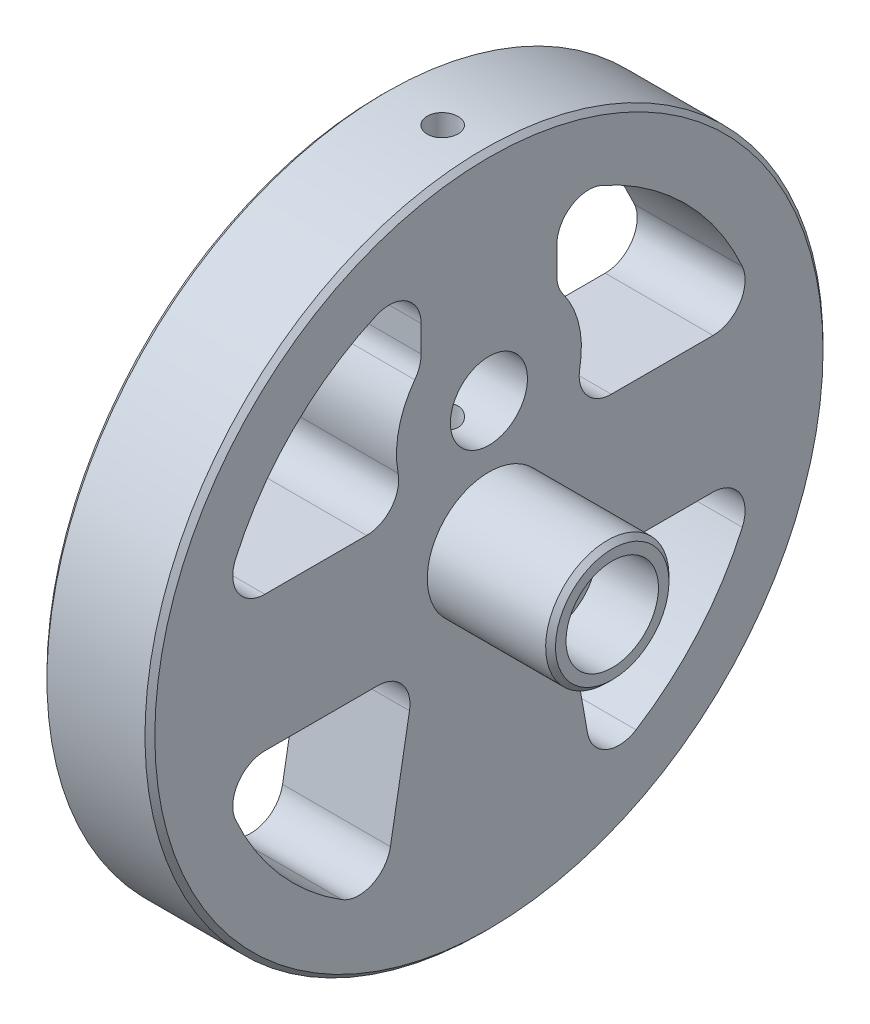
from build123d import *

# Parameters (mm, degrees)
SKETCH2_R                         = 3.96875
CUT_EXTRUDE1_DEPTH                = 55.831983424
CUT_EXTRUDE2_DEPTH                = 55.831983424
SKETCH4_R                         = 1.5875
CUT_EXTRUDE3_DEPTH                = 55.831983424
F_1_4_28_TAPPED_HOLE1_D           = 5.4102
F_1_4_28_TAPPED_HOLE1_DEPTH       = 15.4178
F_1_4_28_TAPPED_HOLE1_CBORE_D     = 6.35
F_1_4_28_TAPPED_HOLE1_CBORE_DEPTH = 12.7
F_1_4_28_TAPPED_HOLE1_TIP         = 1.625388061
CHAMFER1_SIZE                     = 0.508


with BuildPart() as part:
    # Sketch1 → Revolve1 (revolve)
    with BuildSketch(Plane.XY, mode=Mode.PRIVATE) as revolve1_sk:
        Polygon((0, 0), (0, 34.925), (11.1125, 34.925), (11.1125, 6.35), (23.8125, 6.35), (23.8125, 4.7625), (17.4625, 4.7625), (17.4625, 0), align=None)
    revolve(revolve1_sk.sketch.rotate(Axis((0, 0, 0), (1, 0, 0)), 180), axis=Axis((0, 0, 0), (1, 0, 0)))

    # Sketch2 → Cut-Extrude1 (cut, through all)
    with BuildSketch(Plane.ZY):
        with Locations((0, 12.7)):
            Circle(SKETCH2_R)
    extrude(amount=-CUT_EXTRUDE1_DEPTH, mode=Mode.SUBTRACT)

    # Sketch3 → Cut-Extrude2 (cut, through all)
    with BuildSketch(Plane.ZY):
        with BuildLine():
            Line((10.148725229, -22.001160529), (8.184306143, -10.860386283))
            ThreePointArc((8.184306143, -10.860386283), (8.906662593, -8.164515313), (11.436141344, -6.985))
            Line((11.436141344, -6.985), (23.084673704, -6.985))
            ThreePointArc((23.084673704, -6.985), (25.854257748, -8.489054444), (26.100761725, -11.631030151))
            ThreePointArc((26.100761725, -11.631030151), (21.566223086, -18.746430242), (15.15138742, -24.227382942))
            ThreePointArc((15.15138742, -24.227382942), (12.058072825, -24.444549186), (10.148725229, -22.001160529))
        make_face()
        with BuildLine():
            Line((-6.985, 23.084673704), (-6.985, 20.36221639))
            ThreePointArc((-6.985, 20.36221639), (-7.152725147, 19.323214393), (-7.638861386, 18.389764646))
            ThreePointArc((-7.638861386, 18.389764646), (-9.283906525, 14.829484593), (-9.354943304, 10.908168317))
            ThreePointArc((-9.354943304, 10.908168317), (-10.052965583, 8.183181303), (-12.597990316, 6.985))
            Line((-12.597990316, 6.985), (-23.084673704, 6.985))
            ThreePointArc((-23.084673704, 6.985), (-25.854257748, 8.489054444), (-26.100761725, 11.631030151))
            ThreePointArc((-26.100761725, 11.631030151), (-20.205576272, 20.205576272), (-11.631030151, 26.100761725))
            ThreePointArc((-11.631030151, 26.100761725), (-8.489054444, 25.854257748), (-6.985, 23.084673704))
        make_face()
        with BuildLine():
            Line((6.985, 20.36221639), (6.985, 23.084673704))
            ThreePointArc((6.985, 23.084673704), (8.489054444, 25.854257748), (11.631030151, 26.100761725))
            ThreePointArc((11.631030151, 26.100761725), (20.205576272, 20.205576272), (26.100761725, 11.631030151))
            ThreePointArc((26.100761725, 11.631030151), (25.854257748, 8.489054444), (23.084673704, 6.985))
            Line((23.084673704, 6.985), (12.597990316, 6.985))
            ThreePointArc((12.597990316, 6.985), (10.052965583, 8.183181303), (9.354943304, 10.908168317))
            ThreePointArc((9.354943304, 10.908168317), (9.283906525, 14.829484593), (7.638861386, 18.389764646))
            ThreePointArc((7.638861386, 18.389764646), (7.152725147, 19.323214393), (6.985, 20.36221639))
        make_face()
        with BuildLine():
            Line((-8.184306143, -10.860386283), (-10.148725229, -22.001160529))
            ThreePointArc((-10.148725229, -22.001160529), (-12.058072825, -24.444549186), (-15.15138742, -24.227382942))
            ThreePointArc((-15.15138742, -24.227382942), (-21.566223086, -18.746430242), (-26.100761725, -11.631030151))
            ThreePointArc((-26.100761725, -11.631030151), (-25.854257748, -8.489054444), (-23.084673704, -6.985))
            Line((-23.084673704, -6.985), (-11.436141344, -6.985))
            ThreePointArc((-11.436141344, -6.985), (-8.906662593, -8.164515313), (-8.184306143, -10.860386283))
        make_face()
    extrude(amount=-CUT_EXTRUDE2_DEPTH, mode=Mode.SUBTRACT)

    # Sketch4 → Cut-Extrude3 (cut, through all)
    with BuildSketch(Plane(origin=(0, 0, 0), x_dir=(1, 0, 0), z_dir=(0, 1, 0))):
        with Locations(Location((6.35, 0, 0), (0, 0, 90))):
            Circle(SKETCH4_R)
    extrude(amount=CUT_EXTRUDE3_DEPTH, mode=Mode.SUBTRACT)

    # 1_4-28 Tapped Hole1
    with Locations(Plane(origin=(17.4625, 0, 0), x_dir=(0, 0, -1), z_dir=(1, 0, 0))):
        with Locations((0, 0)):
            CounterBoreHole(F_1_4_28_TAPPED_HOLE1_D / 2, F_1_4_28_TAPPED_HOLE1_CBORE_D / 2, F_1_4_28_TAPPED_HOLE1_CBORE_DEPTH, depth=F_1_4_28_TAPPED_HOLE1_DEPTH)
            with Locations((0, 0, -(F_1_4_28_TAPPED_HOLE1_DEPTH + F_1_4_28_TAPPED_HOLE1_TIP / 2))):  # 118° drill point
                Cone(0, F_1_4_28_TAPPED_HOLE1_D / 2, F_1_4_28_TAPPED_HOLE1_TIP, mode=Mode.SUBTRACT)

    # Chamfer1
    chamfer1_edges = [part.edges().sort_by_distance(p)[0] for p in [
        (0, 34.925, 0),
        (11.1125, 34.925, 0),
        (23.8125, 6.35, 0),
    ]]
    chamfer(chamfer1_edges, length=CHAMFER1_SIZE)


solid = part.part
